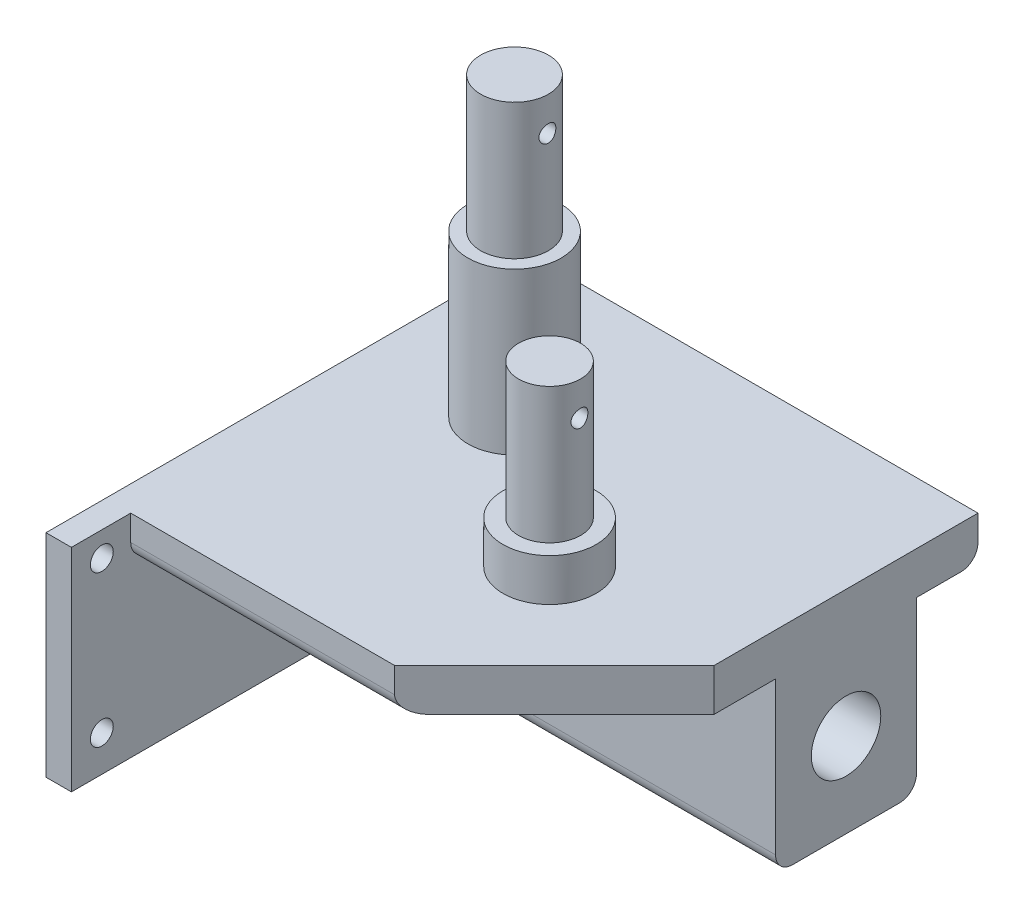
from build123d import *

# Parameters (mm, degrees)
BOSS_EXTRUDE1_DEPTH     = 5
SKETCH2_W               = 50
SKETCH2_H               = 16.625226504
BOSS_EXTRUDE2_DEPTH     = 20
SKETCH3_R               = 4.1
CUT_EXTRUDE1_DEPTH      = 30
FILLET1_R               = 2
SKETCH5_R               = 5.5
BOSS_EXTRUDE3_DEPTH     = 5
SKETCH11_R              = 3.658701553
BOSS_EXTRUDE7_DEPTH     = 16
SKETCH12_R              = 5.5
BOSS_EXTRUDE8_DEPTH     = 14
SKETCH13_R              = 4
BOSS_EXTRUDE9_DEPTH     = 16
CUT_EXTRUDE3_DEPTH      = 69.96617205
CUT_EXTRUDE3_DEPTH_BACK = 69.96617205
SKETCH14_R              = 1
SKETCH8_W               = 57
SKETCH8_H               = 25
BOSS_EXTRUDE5_DEPTH     = 3
CUT_EXTRUDE2_DEPTH      = 72.860968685
CUT_EXTRUDE2_DEPTH_BACK = 72.860968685
SKETCH9_R               = 1.35


with BuildPart() as part:
    # Sketch1 → Boss-Extrude1 (new body)
    with BuildSketch(Plane(origin=(0, 0, 0), x_dir=(1, 0, 0), z_dir=(0, 1, 0))):
        Polygon((5.529592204, -25.618994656), (24.381005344, -6.767581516), (24.381005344, 24.381005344), (-25.618994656, 24.381005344), (-25.618994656, -25.618994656), align=None)
    extrude(amount=BOSS_EXTRUDE1_DEPTH)

    # Sketch2 → Boss-Extrude2 (add)
    with BuildSketch(Plane.XZ):
        with Locations((-0.618994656, -8.806711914)):
            Rectangle(SKETCH2_W, SKETCH2_H)
    extrude(amount=BOSS_EXTRUDE2_DEPTH)

    # Sketch3 → Cut-Extrude1 (cut)
    with BuildSketch(Plane(origin=(24.381005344, 0, 0), x_dir=(0, 0, -1), z_dir=(1, 0, 0))):
        with Locations((8.806711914, -10)):
            Circle(SKETCH3_R)
    extrude(amount=-CUT_EXTRUDE1_DEPTH, mode=Mode.SUBTRACT)

    # Fillet1
    fillet1_edges = [part.edges().sort_by_distance(p)[0] for p in [
        (-0.618994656, -20, -0.494098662),
        (-0.618994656, -20, -17.119325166),
        (-10.044701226, 0, 25.618994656),
        (-0.618994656, 0, -24.381005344),
    ]]
    fillet(fillet1_edges, radius=FILLET1_R)

    # Sketch5 → Boss-Extrude3 (add)
    with BuildSketch(Plane(origin=(0, 5, 0), x_dir=(1, 0, 0), z_dir=(0, 1, 0))):
        with Locations(Location((-12.787602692, 6.849561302, 0), (0, 0, 90))):
            Circle(SKETCH5_R)
        with Locations(Location((4.559891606, -6.365147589, 0), (0, 0, 90))):
            Circle(SKETCH5_R)
    extrude(amount=BOSS_EXTRUDE3_DEPTH)

    # Sketch11 → Boss-Extrude7 (add)
    with BuildSketch(Plane(origin=(0, 10, 0), x_dir=(1, 0, 0), z_dir=(0, 1, 0))):
        with Locations(Location((4.559891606, -6.365147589, 0), (0, 0, 270))):
            Circle(SKETCH11_R)
    extrude(amount=BOSS_EXTRUDE7_DEPTH)

    # Sketch12 → Boss-Extrude8 (add)
    with BuildSketch(Plane(origin=(0, 10, 0), x_dir=(1, 0, 0), z_dir=(0, 1, 0))):
        with Locations(Location((-12.787602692, 6.849561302, 0), (0, 0, 90))):
            Circle(SKETCH12_R)
    extrude(amount=BOSS_EXTRUDE8_DEPTH)

    # Sketch13 → Boss-Extrude9 (add)
    with BuildSketch(Plane(origin=(0, 24, 0), x_dir=(1, 0, 0), z_dir=(0, 1, 0))):
        with Locations(Location((-12.787602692, 6.849561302, 0), (0, 0, 270))):
            Circle(SKETCH13_R)
    extrude(amount=BOSS_EXTRUDE9_DEPTH)

    # Sketch14 → Cut-Extrude3 (cut, two sides: drawn at the far end of the back side and taken through both)
    with BuildSketch(Plane.ZY.offset(25.618994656).offset(-CUT_EXTRUDE3_DEPTH_BACK)):
        with Locations((-6.849561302, 36)):
            Circle(SKETCH14_R)
        with Locations((6.365147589, 22)):
            Circle(SKETCH14_R)
    extrude(amount=CUT_EXTRUDE3_DEPTH + CUT_EXTRUDE3_DEPTH_BACK, mode=Mode.SUBTRACT)

    # Sketch8 → Boss-Extrude5 (add)
    with BuildSketch(Plane.ZY.offset(25.618994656)):
        with Locations((4.118994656, -7.5)):
            Rectangle(SKETCH8_W, SKETCH8_H)
    extrude(amount=BOSS_EXTRUDE5_DEPTH)

    # Sketch9 → Cut-Extrude2 (cut, two sides: drawn at the far end of the back side and taken through both)
    with BuildSketch(Plane(origin=(-25.618994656, 0, 0), x_dir=(0, 0, -1), z_dir=(1, 0, 0)).offset(-CUT_EXTRUDE2_DEPTH_BACK)):
        with Locations((21.116776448, -3.149002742)):
            Circle(SKETCH9_R)
        with Locations((21.116776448, -15.749800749)):
            Circle(SKETCH9_R)
        with Locations((-29.029851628, -15.749800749)):
            Circle(SKETCH9_R)
        with Locations((-29.029851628, 2.091741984)):
            Circle(SKETCH9_R)
    extrude(amount=CUT_EXTRUDE2_DEPTH + CUT_EXTRUDE2_DEPTH_BACK, mode=Mode.SUBTRACT)


solid = part.part
